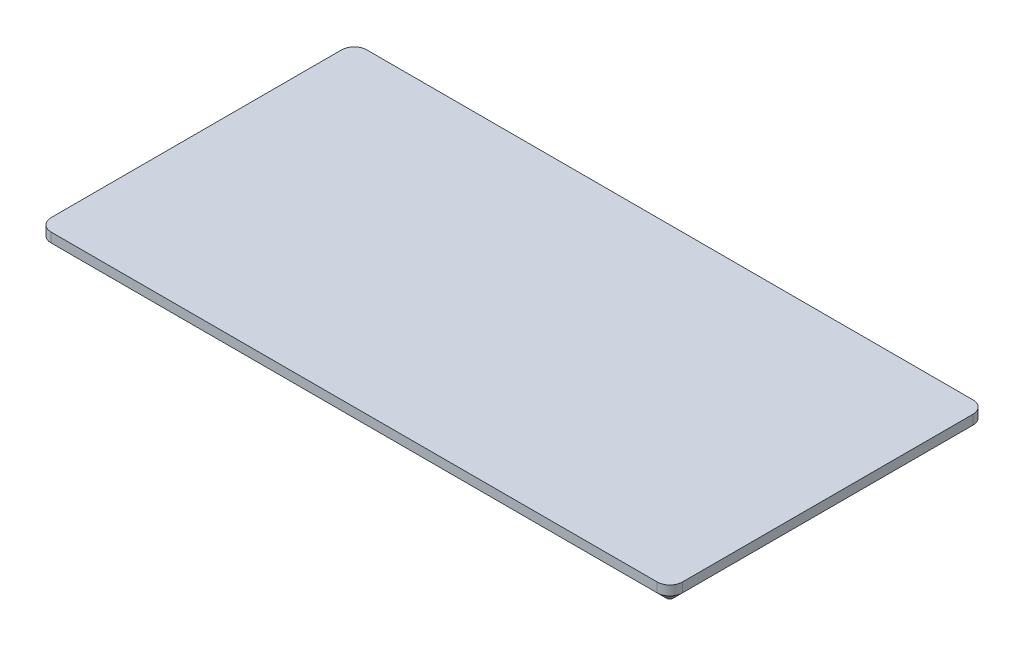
from build123d import *

# Parameters (mm, degrees)
SKETCH1_W           = 1000
SKETCH1_H           = 500
BOSS_EXTRUDE1_DEPTH = 30
FILLET2_R           = 20
CHAMFER2_SIZE       = 15


with BuildPart() as part:
    # Sketch1 → Boss-Extrude1 (new body)
    with BuildSketch(Plane(origin=(0, 0, 0), x_dir=(1, 0, 0), z_dir=(0, 1, 0))):
        Rectangle(SKETCH1_W, SKETCH1_H)
    extrude(amount=BOSS_EXTRUDE1_DEPTH)

    # Fillet2
    fillet2_edges = [part.edges().sort_by_distance(p)[0] for p in [
        (500, 15, 250),
        (-500, 15, 250),
        (-500, 15, -250),
        (500, 15, -250),
    ]]
    fillet(fillet2_edges, radius=FILLET2_R)

    # Chamfer2
    chamfer2_edges = [part.edges().sort_by_distance(p)[0] for p in [
        (500, 0, 0),
        (0, 0, 250),
        (-500, 0, 0),
        (0, 0, -250),
        (-494.142135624, 0, -244.142135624),
        (494.142135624, 0, -244.142135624),
        (-494.142135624, 0, 244.142135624),
        (494.142135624, 0, 244.142135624),
    ]]
    chamfer(chamfer2_edges, length=CHAMFER2_SIZE)


solid = part.part
